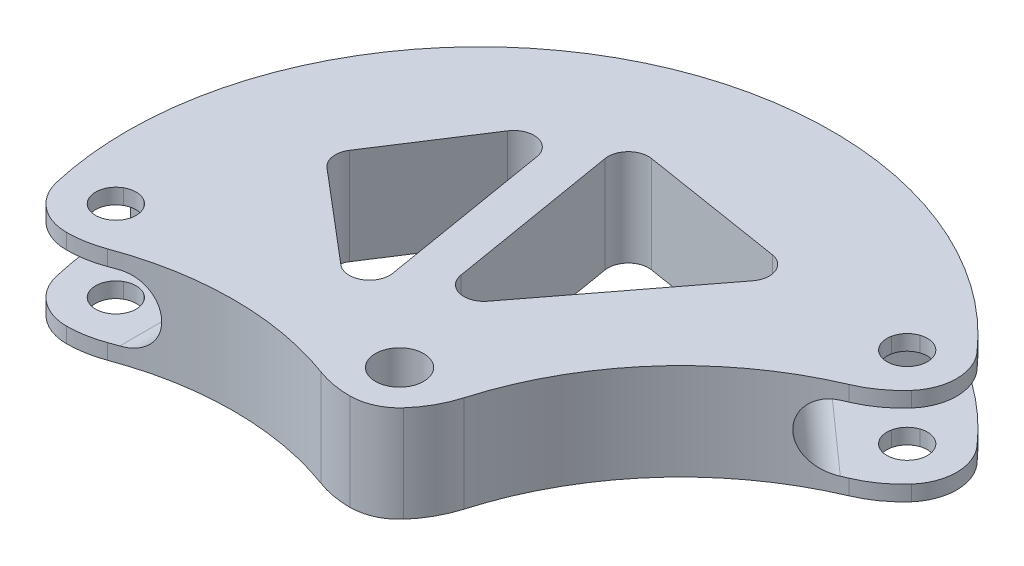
from build123d import *

# Parameters (mm, degrees)
MAIN_BODY_DEPTH      = 9.525
MAIN_BODY_DEPTH_BACK = 9.525
SKETCH1_R            = 4
SKETCH1_R_2          = 4.765
DAMPER_HOLE_DEPTH    = 24
A_ARM_HOLE_DEPTH     = 24
WEIGHT_CUTS_DEPTH    = 87.702682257


with BuildPart() as part:
    # Sketch1 → Main Body (new, two sides: drawn at the far end of the back side and taken through both)
    with BuildSketch(Plane(origin=(0, 0, 0), x_dir=(1, 0, 0), z_dir=(0, 1, 0)).offset(-MAIN_BODY_DEPTH_BACK)):
        with BuildLine():
            Line((-51.566964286, -36.313977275), (4.433035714, -36.313977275))
            ThreePointArc((4.433035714, -36.313977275), (8.436339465, -35.455648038), (11.735874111, -33.031552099))
            Line((11.735874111, -33.031552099), (58.869802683, 20.066402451))
            ThreePointArc((58.869802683, 20.066402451), (61.331950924, 26.532822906), (58.8912111, 33.007354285))
            ThreePointArc((58.8912111, 33.007354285), (-25.151135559, 48.851889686), (-61.078702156, -28.758517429))
            ThreePointArc((-61.078702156, -28.758517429), (-57.640639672, -34.195263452), (-51.566964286, -36.313977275))
        make_face()
        with Locations(Location((-51.566964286, -26.548977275, 0), (0, 0, 270))):
            Circle(SKETCH1_R, mode=Mode.SUBTRACT)
        with Locations(Location((4.433035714, -26.548977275, 0), (0, 0, 270))):
            Circle(SKETCH1_R_2, mode=Mode.SUBTRACT)
        with Locations(Location((51.566964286, 26.548977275, 0), (0, 0, 270))):
            Circle(SKETCH1_R, mode=Mode.SUBTRACT)
    extrude(amount=MAIN_BODY_DEPTH + MAIN_BODY_DEPTH_BACK)

    # Sketch2 → Damper Hole (cut)
    with BuildSketch(Plane.XY.offset(36.313977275)):
        with BuildLine():
            Line((-62.883398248, 6.5), (-42.883398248, 6.5))
            ThreePointArc((-42.883398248, 6.5), (-36.383398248, 0), (-42.883398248, -6.5))
            Line((-42.883398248, -6.5), (-62.883398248, -6.5))
            Line((-62.883398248, -6.5), (-62.883398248, 6.5))
        make_face()
    extrude(amount=-DAMPER_HOLE_DEPTH, mode=Mode.SUBTRACT)

    # Sketch3 → A Arm Hole (cut)
    with BuildSketch(Plane(origin=(22.963024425, 0, 20.383789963), x_dir=(0.66385814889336, 0, -0.7478585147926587), z_dir=(0.7478585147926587, 0, 0.66385814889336))):
        with BuildLine():
            Line((64.298905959, 6.5), (44.298905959, 6.5))
            ThreePointArc((44.298905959, 6.5), (37.798905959, 0), (44.298905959, -6.5))
            Line((44.298905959, -6.5), (64.298905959, -6.5))
            Line((64.298905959, -6.5), (64.298905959, 6.5))
        make_face()
    extrude(amount=-A_ARM_HOLE_DEPTH, mode=Mode.SUBTRACT)

    # Sketch7 → Weight Cuts (cut, through all)
    with BuildSketch(Plane(origin=(0, 9.525, 0), x_dir=(1, 0, 0), z_dir=(0, 1, 0))):
        with BuildLine():
            Line((-51.566964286, -36.313977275), (4.433035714, -36.313977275))
            ThreePointArc((4.433035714, -36.313977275), (0.917222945, -36.002528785), (-2.489090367, -35.077883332))
            ThreePointArc((-2.489090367, -35.077883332), (-23.566964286, -31.313977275), (-44.644838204, -35.077883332))
            ThreePointArc((-44.644838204, -35.077883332), (-48.051151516, -36.002528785), (-51.566964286, -36.313977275))
        make_face()
        with BuildLine():
            Line((11.735874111, -33.031552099), (58.869802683, 20.066402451))
            ThreePointArc((58.869802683, 20.066402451), (55.585052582, 17.103041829), (51.729197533, 14.934293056))
            ThreePointArc((51.729197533, 14.934293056), (29.319970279, -1.171709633), (15.985004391, -25.332741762))
            ThreePointArc((15.985004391, -25.332741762), (14.28880392, -29.418570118), (11.735874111, -33.031552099))
        make_face()
        with BuildLine():
            Line((-18.047369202, 23.07846678), (-12.340376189, -11.100104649))
            ThreePointArc((-12.340376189, -11.100104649), (-14.309451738, -15.236562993), (-18.870885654, -14.81127864))
            Line((-18.870885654, -14.81127864), (-36.861204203, 0.425083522))
            ThreePointArc((-36.861204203, 0.425083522), (-38.2332834, 2.893966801), (-37.632201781, 5.653801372))
            Line((-37.632201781, 5.653801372), (-25.348876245, 24.596010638))
            ThreePointArc((-25.348876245, 24.596010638), (-21.178782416, 26.335991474), (-18.047369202, 23.07846678))
        make_face()
        with BuildLine():
            Line((-11.000727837, 29.451341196), (-5.293734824, -4.727230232))
            ThreePointArc((-5.293734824, -4.727230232), (-2.312958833, -7.950398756), (1.829790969, -6.497310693))
            Line((1.829790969, -6.497310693), (24.490978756, 23.154675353))
            ThreePointArc((24.490978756, 23.154675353), (25.027479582, 27.067244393), (21.943119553, 29.533568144))
            Line((21.943119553, 29.533568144), (-6.425061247, 34.060153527))
            ThreePointArc((-6.425061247, 34.060153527), (-9.893966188, 32.928324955), (-11.000727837, 29.451341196))
        make_face()
    extrude(amount=-WEIGHT_CUTS_DEPTH, mode=Mode.SUBTRACT)


solid = part.part
